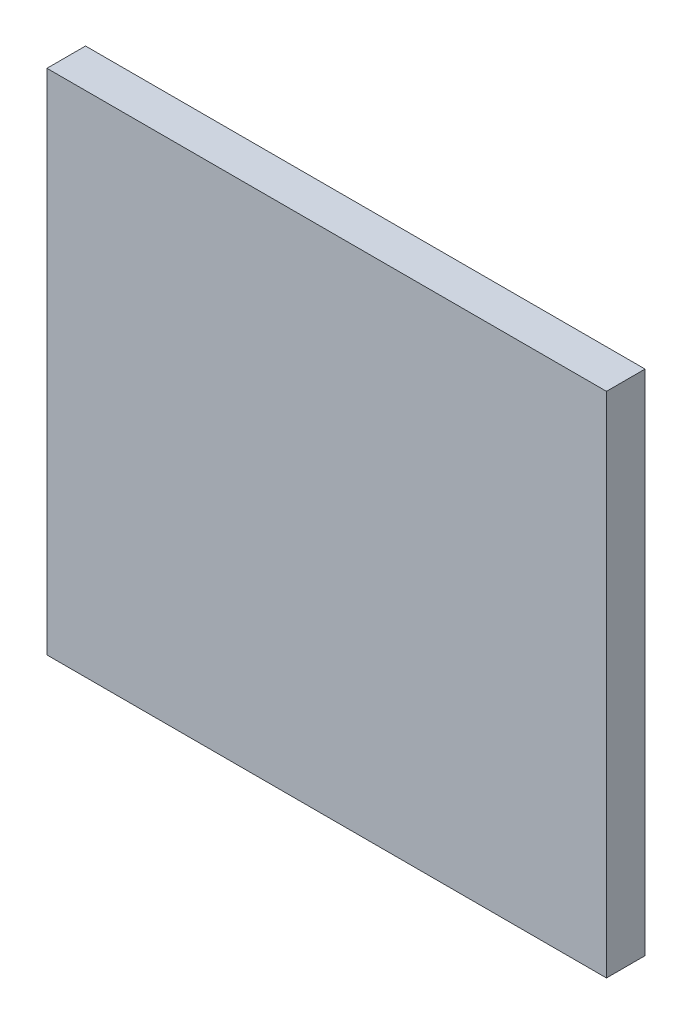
ISO-10303-21;
HEADER;
FILE_DESCRIPTION(('STEP AP214'),'2;1');
FILE_NAME('part.step','',(''),(''),'','','');
FILE_SCHEMA(('AUTOMOTIVE_DESIGN { 1 0 10303 214 1 1 1 1 }'));
ENDSEC;
DATA;
#1=APPLICATION_CONTEXT('core data for automotive mechanical design processes');
#2=APPLICATION_PROTOCOL_DEFINITION('international standard','automotive_design',2000,#1);
#3=PRODUCT_CONTEXT('',#1,'mechanical');
#4=PRODUCT('Part','Part','',(#3));
#5=PRODUCT_RELATED_PRODUCT_CATEGORY('part','',(#4));
#6=PRODUCT_DEFINITION_FORMATION('','',#4);
#7=PRODUCT_DEFINITION_CONTEXT('part definition',#1,'design');
#8=PRODUCT_DEFINITION('design','',#6,#7);
#9=PRODUCT_DEFINITION_SHAPE('','',#8);
#10=(LENGTH_UNIT() NAMED_UNIT(*) SI_UNIT(.MILLI.,.METRE.));
#11=(NAMED_UNIT(*) PLANE_ANGLE_UNIT() SI_UNIT($,.RADIAN.));
#12=(NAMED_UNIT(*) SI_UNIT($,.STERADIAN.) SOLID_ANGLE_UNIT());
#13=UNCERTAINTY_MEASURE_WITH_UNIT(LENGTH_MEASURE(1.E-05),#10,'distance_accuracy_value','');
#14=(GEOMETRIC_REPRESENTATION_CONTEXT(3) GLOBAL_UNCERTAINTY_ASSIGNED_CONTEXT((#13)) GLOBAL_UNIT_ASSIGNED_CONTEXT((#10,
#11,#12)) REPRESENTATION_CONTEXT('',''));
#15=CARTESIAN_POINT('',(0.,0.,0.));
#16=DIRECTION('',(0.,0.,1.));
#17=DIRECTION('',(1.,0.,0.));
#18=AXIS2_PLACEMENT_3D('',#15,#16,#17);
#19=CARTESIAN_POINT('',(0.,0.,12.));
#20=DIRECTION('',(0.,0.,1.));
#21=DIRECTION('',(1.,0.,0.));
#22=AXIS2_PLACEMENT_3D('',#19,#20,#21);
#23=PLANE('',#22);
#24=DIRECTION('',(1.,0.,0.));
#25=VECTOR('',#24,1.);
#26=CARTESIAN_POINT('',(-87.,-79.,12.));
#27=LINE('',#26,#25);
#28=CARTESIAN_POINT('',(-87.,-79.,12.));
#29=VERTEX_POINT('',#28);
#30=CARTESIAN_POINT('',(87.,-79.,12.));
#31=VERTEX_POINT('',#30);
#32=EDGE_CURVE('E87',#29,#31,#27,.T.);
#33=ORIENTED_EDGE('',*,*,#32,.T.);
#34=DIRECTION('',(0.,1.,0.));
#35=VECTOR('',#34,1.);
#36=CARTESIAN_POINT('',(87.,-79.,12.));
#37=LINE('',#36,#35);
#38=CARTESIAN_POINT('',(87.,79.,12.));
#39=VERTEX_POINT('',#38);
#40=EDGE_CURVE('E109',#31,#39,#37,.T.);
#41=ORIENTED_EDGE('',*,*,#40,.T.);
#42=DIRECTION('',(-1.,0.,0.));
#43=VECTOR('',#42,1.);
#44=CARTESIAN_POINT('',(87.,79.,12.));
#45=LINE('',#44,#43);
#46=CARTESIAN_POINT('',(-87.,79.,12.));
#47=VERTEX_POINT('',#46);
#48=EDGE_CURVE('E49',#39,#47,#45,.T.);
#49=ORIENTED_EDGE('',*,*,#48,.T.);
#50=DIRECTION('',(0.,-1.,0.));
#51=VECTOR('',#50,1.);
#52=CARTESIAN_POINT('',(-87.,79.,12.));
#53=LINE('',#52,#51);
#54=EDGE_CURVE('E10',#47,#29,#53,.T.);
#55=ORIENTED_EDGE('',*,*,#54,.T.);
#56=EDGE_LOOP('',(#33,#41,#49,#55));
#57=FACE_BOUND('',#56,.T.);
#58=ADVANCED_FACE('F16',(#57),#23,.T.);
#59=CARTESIAN_POINT('',(0.,0.,0.));
#60=DIRECTION('',(0.,0.,1.));
#61=DIRECTION('',(1.,0.,0.));
#62=AXIS2_PLACEMENT_3D('',#59,#60,#61);
#63=PLANE('',#62);
#64=DIRECTION('',(0.,-1.,0.));
#65=VECTOR('',#64,1.);
#66=CARTESIAN_POINT('',(-87.,79.,0.));
#67=LINE('',#66,#65);
#68=CARTESIAN_POINT('',(-87.,79.,0.));
#69=VERTEX_POINT('',#68);
#70=CARTESIAN_POINT('',(-87.,-79.,0.));
#71=VERTEX_POINT('',#70);
#72=EDGE_CURVE('E26',#69,#71,#67,.T.);
#73=ORIENTED_EDGE('',*,*,#72,.F.);
#74=DIRECTION('',(-1.,0.,0.));
#75=VECTOR('',#74,1.);
#76=CARTESIAN_POINT('',(87.,79.,0.));
#77=LINE('',#76,#75);
#78=CARTESIAN_POINT('',(87.,79.,0.));
#79=VERTEX_POINT('',#78);
#80=EDGE_CURVE('E58',#79,#69,#77,.T.);
#81=ORIENTED_EDGE('',*,*,#80,.F.);
#82=DIRECTION('',(0.,1.,0.));
#83=VECTOR('',#82,1.);
#84=CARTESIAN_POINT('',(87.,-79.,0.));
#85=LINE('',#84,#83);
#86=CARTESIAN_POINT('',(87.,-79.,0.));
#87=VERTEX_POINT('',#86);
#88=EDGE_CURVE('E89',#87,#79,#85,.T.);
#89=ORIENTED_EDGE('',*,*,#88,.F.);
#90=DIRECTION('',(1.,0.,0.));
#91=VECTOR('',#90,1.);
#92=CARTESIAN_POINT('',(-87.,-79.,0.));
#93=LINE('',#92,#91);
#94=EDGE_CURVE('E86',#71,#87,#93,.T.);
#95=ORIENTED_EDGE('',*,*,#94,.F.);
#96=EDGE_LOOP('',(#73,#81,#89,#95));
#97=FACE_BOUND('',#96,.T.);
#98=ADVANCED_FACE('F91',(#97),#63,.F.);
#99=CARTESIAN_POINT('',(-87.,79.,0.));
#100=DIRECTION('',(1.,0.,0.));
#101=DIRECTION('',(0.,1.,0.));
#102=AXIS2_PLACEMENT_3D('',#99,#100,#101);
#103=PLANE('',#102);
#104=ORIENTED_EDGE('',*,*,#72,.T.);
#105=DIRECTION('',(0.,0.,1.));
#106=VECTOR('',#105,1.);
#107=CARTESIAN_POINT('',(-87.,-79.,0.));
#108=LINE('',#107,#106);
#109=EDGE_CURVE('E76',#71,#29,#108,.T.);
#110=ORIENTED_EDGE('',*,*,#109,.T.);
#111=ORIENTED_EDGE('',*,*,#54,.F.);
#112=DIRECTION('',(0.,0.,1.));
#113=VECTOR('',#112,1.);
#114=CARTESIAN_POINT('',(-87.,79.,0.));
#115=LINE('',#114,#113);
#116=EDGE_CURVE('E78',#69,#47,#115,.T.);
#117=ORIENTED_EDGE('',*,*,#116,.F.);
#118=EDGE_LOOP('',(#104,#110,#111,#117));
#119=FACE_BOUND('',#118,.T.);
#120=ADVANCED_FACE('F18',(#119),#103,.F.);
#121=CARTESIAN_POINT('',(87.,79.,0.));
#122=DIRECTION('',(0.,-1.,0.));
#123=DIRECTION('',(0.,0.,-1.));
#124=AXIS2_PLACEMENT_3D('',#121,#122,#123);
#125=PLANE('',#124);
#126=ORIENTED_EDGE('',*,*,#80,.T.);
#127=ORIENTED_EDGE('',*,*,#116,.T.);
#128=ORIENTED_EDGE('',*,*,#48,.F.);
#129=DIRECTION('',(0.,0.,1.));
#130=VECTOR('',#129,1.);
#131=CARTESIAN_POINT('',(87.,79.,0.));
#132=LINE('',#131,#130);
#133=EDGE_CURVE('E105',#79,#39,#132,.T.);
#134=ORIENTED_EDGE('',*,*,#133,.F.);
#135=EDGE_LOOP('',(#126,#127,#128,#134));
#136=FACE_BOUND('',#135,.T.);
#137=ADVANCED_FACE('F117',(#136),#125,.F.);
#138=CARTESIAN_POINT('',(87.,-79.,0.));
#139=DIRECTION('',(-1.,0.,0.));
#140=DIRECTION('',(0.,0.,1.));
#141=AXIS2_PLACEMENT_3D('',#138,#139,#140);
#142=PLANE('',#141);
#143=ORIENTED_EDGE('',*,*,#88,.T.);
#144=ORIENTED_EDGE('',*,*,#133,.T.);
#145=ORIENTED_EDGE('',*,*,#40,.F.);
#146=DIRECTION('',(0.,0.,1.));
#147=VECTOR('',#146,1.);
#148=CARTESIAN_POINT('',(87.,-79.,0.));
#149=LINE('',#148,#147);
#150=EDGE_CURVE('E95',#87,#31,#149,.T.);
#151=ORIENTED_EDGE('',*,*,#150,.F.);
#152=EDGE_LOOP('',(#143,#144,#145,#151));
#153=FACE_BOUND('',#152,.T.);
#154=ADVANCED_FACE('F119',(#153),#142,.F.);
#155=CARTESIAN_POINT('',(-87.,-79.,0.));
#156=DIRECTION('',(0.,1.,0.));
#157=DIRECTION('',(1.,0.,0.));
#158=AXIS2_PLACEMENT_3D('',#155,#156,#157);
#159=PLANE('',#158);
#160=ORIENTED_EDGE('',*,*,#94,.T.);
#161=ORIENTED_EDGE('',*,*,#150,.T.);
#162=ORIENTED_EDGE('',*,*,#32,.F.);
#163=ORIENTED_EDGE('',*,*,#109,.F.);
#164=EDGE_LOOP('',(#160,#161,#162,#163));
#165=FACE_BOUND('',#164,.T.);
#166=ADVANCED_FACE('F84',(#165),#159,.F.);
#167=CLOSED_SHELL('',(#58,#98,#120,#137,#154,#166));
#168=MANIFOLD_SOLID_BREP('B1',#167);
#169=ADVANCED_BREP_SHAPE_REPRESENTATION('',(#18,#168),#14);
#170=SHAPE_DEFINITION_REPRESENTATION(#9,#169);
ENDSEC;
END-ISO-10303-21;
